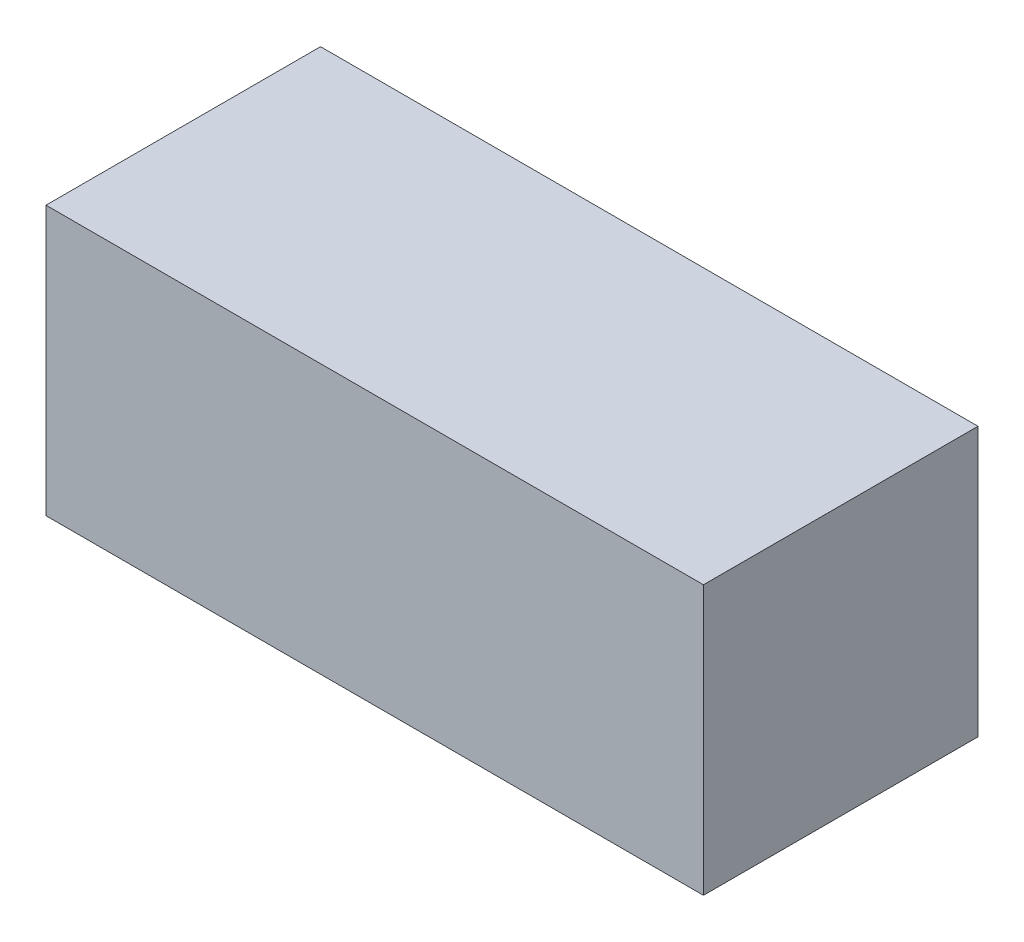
ISO-10303-21;
HEADER;
FILE_DESCRIPTION(('STEP AP214'),'2;1');
FILE_NAME('part.step','',(''),(''),'','','');
FILE_SCHEMA(('AUTOMOTIVE_DESIGN { 1 0 10303 214 1 1 1 1 }'));
ENDSEC;
DATA;
#1=APPLICATION_CONTEXT('core data for automotive mechanical design processes');
#2=APPLICATION_PROTOCOL_DEFINITION('international standard','automotive_design',2000,#1);
#3=PRODUCT_CONTEXT('',#1,'mechanical');
#4=PRODUCT('Part','Part','',(#3));
#5=PRODUCT_RELATED_PRODUCT_CATEGORY('part','',(#4));
#6=PRODUCT_DEFINITION_FORMATION('','',#4);
#7=PRODUCT_DEFINITION_CONTEXT('part definition',#1,'design');
#8=PRODUCT_DEFINITION('design','',#6,#7);
#9=PRODUCT_DEFINITION_SHAPE('','',#8);
#10=(LENGTH_UNIT() NAMED_UNIT(*) SI_UNIT(.MILLI.,.METRE.));
#11=(NAMED_UNIT(*) PLANE_ANGLE_UNIT() SI_UNIT($,.RADIAN.));
#12=(NAMED_UNIT(*) SI_UNIT($,.STERADIAN.) SOLID_ANGLE_UNIT());
#13=UNCERTAINTY_MEASURE_WITH_UNIT(LENGTH_MEASURE(1.E-05),#10,'distance_accuracy_value','');
#14=(GEOMETRIC_REPRESENTATION_CONTEXT(3) GLOBAL_UNCERTAINTY_ASSIGNED_CONTEXT((#13)) GLOBAL_UNIT_ASSIGNED_CONTEXT((#10,
#11,#12)) REPRESENTATION_CONTEXT('',''));
#15=CARTESIAN_POINT('',(0.,0.,0.));
#16=DIRECTION('',(0.,0.,1.));
#17=DIRECTION('',(1.,0.,0.));
#18=AXIS2_PLACEMENT_3D('',#15,#16,#17);
#19=CARTESIAN_POINT('',(0.,0.,0.70000114));
#20=DIRECTION('',(0.,0.,-1.));
#21=DIRECTION('',(0.,-1.,0.));
#22=AXIS2_PLACEMENT_3D('',#19,#20,#21);
#23=PLANE('',#22);
#24=DIRECTION('',(1.,0.,0.));
#25=VECTOR('',#24,1.);
#26=CARTESIAN_POINT('',(-0.8382,0.3429,0.70000114));
#27=LINE('',#26,#25);
#28=CARTESIAN_POINT('',(-0.8382,0.3429,0.70000114));
#29=VERTEX_POINT('',#28);
#30=CARTESIAN_POINT('',(0.8382,0.3429,0.70000114));
#31=VERTEX_POINT('',#30);
#32=EDGE_CURVE('E20',#29,#31,#27,.T.);
#33=ORIENTED_EDGE('',*,*,#32,.F.);
#34=DIRECTION('',(0.,1.,0.));
#35=VECTOR('',#34,1.);
#36=CARTESIAN_POINT('',(-0.8382,-0.3429,0.70000114));
#37=LINE('',#36,#35);
#38=CARTESIAN_POINT('',(-0.8382,-0.3429,0.70000114));
#39=VERTEX_POINT('',#38);
#40=EDGE_CURVE('E111',#39,#29,#37,.T.);
#41=ORIENTED_EDGE('',*,*,#40,.F.);
#42=DIRECTION('',(-1.,0.,0.));
#43=VECTOR('',#42,1.);
#44=CARTESIAN_POINT('',(0.8382,-0.3429,0.70000114));
#45=LINE('',#44,#43);
#46=CARTESIAN_POINT('',(0.8382,-0.3429,0.70000114));
#47=VERTEX_POINT('',#46);
#48=EDGE_CURVE('E71',#47,#39,#45,.T.);
#49=ORIENTED_EDGE('',*,*,#48,.F.);
#50=DIRECTION('',(0.,-1.,0.));
#51=VECTOR('',#50,1.);
#52=CARTESIAN_POINT('',(0.8382,0.3429,0.70000114));
#53=LINE('',#52,#51);
#54=EDGE_CURVE('E94',#31,#47,#53,.T.);
#55=ORIENTED_EDGE('',*,*,#54,.F.);
#56=EDGE_LOOP('',(#33,#41,#49,#55));
#57=FACE_BOUND('',#56,.T.);
#58=ADVANCED_FACE('F17',(#57),#23,.F.);
#59=CARTESIAN_POINT('',(0.,0.,0.));
#60=DIRECTION('',(0.,0.,-1.));
#61=DIRECTION('',(0.,-1.,0.));
#62=AXIS2_PLACEMENT_3D('',#59,#60,#61);
#63=PLANE('',#62);
#64=DIRECTION('',(0.,-1.,0.));
#65=VECTOR('',#64,1.);
#66=CARTESIAN_POINT('',(0.8382,0.3429,0.));
#67=LINE('',#66,#65);
#68=CARTESIAN_POINT('',(0.8382,0.3429,0.));
#69=VERTEX_POINT('',#68);
#70=CARTESIAN_POINT('',(0.8382,-0.3429,0.));
#71=VERTEX_POINT('',#70);
#72=EDGE_CURVE('E80',#69,#71,#67,.T.);
#73=ORIENTED_EDGE('',*,*,#72,.T.);
#74=DIRECTION('',(-1.,0.,0.));
#75=VECTOR('',#74,1.);
#76=CARTESIAN_POINT('',(0.8382,-0.3429,0.));
#77=LINE('',#76,#75);
#78=CARTESIAN_POINT('',(-0.8382,-0.3429,0.));
#79=VERTEX_POINT('',#78);
#80=EDGE_CURVE('E62',#71,#79,#77,.T.);
#81=ORIENTED_EDGE('',*,*,#80,.T.);
#82=DIRECTION('',(0.,1.,0.));
#83=VECTOR('',#82,1.);
#84=CARTESIAN_POINT('',(-0.8382,-0.3429,0.));
#85=LINE('',#84,#83);
#86=CARTESIAN_POINT('',(-0.8382,0.3429,0.));
#87=VERTEX_POINT('',#86);
#88=EDGE_CURVE('E82',#79,#87,#85,.T.);
#89=ORIENTED_EDGE('',*,*,#88,.T.);
#90=DIRECTION('',(1.,0.,0.));
#91=VECTOR('',#90,1.);
#92=CARTESIAN_POINT('',(-0.8382,0.3429,0.));
#93=LINE('',#92,#91);
#94=EDGE_CURVE('E11',#87,#69,#93,.T.);
#95=ORIENTED_EDGE('',*,*,#94,.T.);
#96=EDGE_LOOP('',(#73,#81,#89,#95));
#97=FACE_BOUND('',#96,.T.);
#98=ADVANCED_FACE('F79',(#97),#63,.T.);
#99=CARTESIAN_POINT('',(-0.8382,0.3429,0.));
#100=DIRECTION('',(0.,1.,0.));
#101=DIRECTION('',(1.,0.,0.));
#102=AXIS2_PLACEMENT_3D('',#99,#100,#101);
#103=PLANE('',#102);
#104=DIRECTION('',(0.,0.,1.));
#105=VECTOR('',#104,1.);
#106=CARTESIAN_POINT('',(-0.8382,0.3429,0.));
#107=LINE('',#106,#105);
#108=EDGE_CURVE('E108',#87,#29,#107,.T.);
#109=ORIENTED_EDGE('',*,*,#108,.T.);
#110=ORIENTED_EDGE('',*,*,#32,.T.);
#111=DIRECTION('',(0.,0.,1.));
#112=VECTOR('',#111,1.);
#113=CARTESIAN_POINT('',(0.8382,0.3429,0.));
#114=LINE('',#113,#112);
#115=EDGE_CURVE('E88',#69,#31,#114,.T.);
#116=ORIENTED_EDGE('',*,*,#115,.F.);
#117=ORIENTED_EDGE('',*,*,#94,.F.);
#118=EDGE_LOOP('',(#109,#110,#116,#117));
#119=FACE_BOUND('',#118,.T.);
#120=ADVANCED_FACE('F92',(#119),#103,.T.);
#121=CARTESIAN_POINT('',(-0.8382,-0.3429,0.));
#122=DIRECTION('',(-1.,0.,0.));
#123=DIRECTION('',(0.,0.,1.));
#124=AXIS2_PLACEMENT_3D('',#121,#122,#123);
#125=PLANE('',#124);
#126=DIRECTION('',(0.,0.,1.));
#127=VECTOR('',#126,1.);
#128=CARTESIAN_POINT('',(-0.8382,-0.3429,0.));
#129=LINE('',#128,#127);
#130=EDGE_CURVE('E107',#79,#39,#129,.T.);
#131=ORIENTED_EDGE('',*,*,#130,.T.);
#132=ORIENTED_EDGE('',*,*,#40,.T.);
#133=ORIENTED_EDGE('',*,*,#108,.F.);
#134=ORIENTED_EDGE('',*,*,#88,.F.);
#135=EDGE_LOOP('',(#131,#132,#133,#134));
#136=FACE_BOUND('',#135,.T.);
#137=ADVANCED_FACE('F145',(#136),#125,.T.);
#138=CARTESIAN_POINT('',(0.8382,-0.3429,0.));
#139=DIRECTION('',(0.,-1.,0.));
#140=DIRECTION('',(0.,0.,-1.));
#141=AXIS2_PLACEMENT_3D('',#138,#139,#140);
#142=PLANE('',#141);
#143=DIRECTION('',(0.,0.,1.));
#144=VECTOR('',#143,1.);
#145=CARTESIAN_POINT('',(0.8382,-0.3429,0.));
#146=LINE('',#145,#144);
#147=EDGE_CURVE('E89',#71,#47,#146,.T.);
#148=ORIENTED_EDGE('',*,*,#147,.T.);
#149=ORIENTED_EDGE('',*,*,#48,.T.);
#150=ORIENTED_EDGE('',*,*,#130,.F.);
#151=ORIENTED_EDGE('',*,*,#80,.F.);
#152=EDGE_LOOP('',(#148,#149,#150,#151));
#153=FACE_BOUND('',#152,.T.);
#154=ADVANCED_FACE('F135',(#153),#142,.T.);
#155=CARTESIAN_POINT('',(0.8382,0.3429,0.));
#156=DIRECTION('',(1.,0.,0.));
#157=DIRECTION('',(0.,1.,0.));
#158=AXIS2_PLACEMENT_3D('',#155,#156,#157);
#159=PLANE('',#158);
#160=ORIENTED_EDGE('',*,*,#115,.T.);
#161=ORIENTED_EDGE('',*,*,#54,.T.);
#162=ORIENTED_EDGE('',*,*,#147,.F.);
#163=ORIENTED_EDGE('',*,*,#72,.F.);
#164=EDGE_LOOP('',(#160,#161,#162,#163));
#165=FACE_BOUND('',#164,.T.);
#166=ADVANCED_FACE('F86',(#165),#159,.T.);
#167=CLOSED_SHELL('',(#58,#98,#120,#137,#154,#166));
#168=MANIFOLD_SOLID_BREP('B1',#167);
#169=ADVANCED_BREP_SHAPE_REPRESENTATION('',(#18,#168),#14);
#170=SHAPE_DEFINITION_REPRESENTATION(#9,#169);
ENDSEC;
END-ISO-10303-21;
